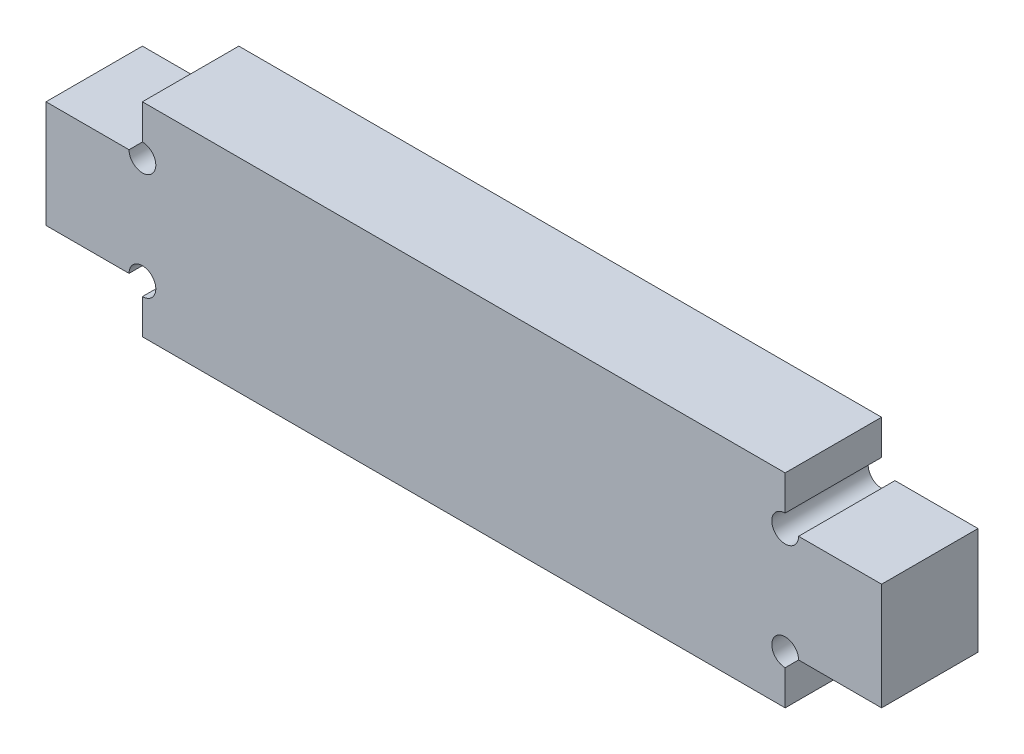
ISO-10303-21;
HEADER;
FILE_DESCRIPTION(('STEP AP214'),'2;1');
FILE_NAME('part.step','',(''),(''),'','','');
FILE_SCHEMA(('AUTOMOTIVE_DESIGN { 1 0 10303 214 1 1 1 1 }'));
ENDSEC;
DATA;
#1=APPLICATION_CONTEXT('core data for automotive mechanical design processes');
#2=APPLICATION_PROTOCOL_DEFINITION('international standard','automotive_design',2000,#1);
#3=PRODUCT_CONTEXT('',#1,'mechanical');
#4=PRODUCT('Part','Part','',(#3));
#5=PRODUCT_RELATED_PRODUCT_CATEGORY('part','',(#4));
#6=PRODUCT_DEFINITION_FORMATION('','',#4);
#7=PRODUCT_DEFINITION_CONTEXT('part definition',#1,'design');
#8=PRODUCT_DEFINITION('design','',#6,#7);
#9=PRODUCT_DEFINITION_SHAPE('','',#8);
#10=(LENGTH_UNIT() NAMED_UNIT(*) SI_UNIT(.MILLI.,.METRE.));
#11=(NAMED_UNIT(*) PLANE_ANGLE_UNIT() SI_UNIT($,.RADIAN.));
#12=(NAMED_UNIT(*) SI_UNIT($,.STERADIAN.) SOLID_ANGLE_UNIT());
#13=UNCERTAINTY_MEASURE_WITH_UNIT(LENGTH_MEASURE(1.E-05),#10,'distance_accuracy_value','');
#14=(GEOMETRIC_REPRESENTATION_CONTEXT(3) GLOBAL_UNCERTAINTY_ASSIGNED_CONTEXT((#13)) GLOBAL_UNIT_ASSIGNED_CONTEXT((#10,
#11,#12)) REPRESENTATION_CONTEXT('',''));
#15=CARTESIAN_POINT('',(0.,0.,0.));
#16=DIRECTION('',(0.,0.,1.));
#17=DIRECTION('',(1.,0.,0.));
#18=AXIS2_PLACEMENT_3D('',#15,#16,#17);
#19=CARTESIAN_POINT('',(-60.,-10.,18.));
#20=DIRECTION('',(0.,0.,-1.));
#21=DIRECTION('',(-1.,0.,0.));
#22=AXIS2_PLACEMENT_3D('',#19,#20,#21);
#23=CYLINDRICAL_SURFACE('',#22,2.5);
#24=CARTESIAN_POINT('',(-60.,-10.,0.));
#25=DIRECTION('',(0.,0.,-1.));
#26=DIRECTION('',(1.,0.,0.));
#27=AXIS2_PLACEMENT_3D('',#24,#25,#26);
#28=CIRCLE('',#27,2.5);
#29=CARTESIAN_POINT('',(-62.5,-10.,0.));
#30=VERTEX_POINT('',#29);
#31=CARTESIAN_POINT('',(-60.,-12.5,0.));
#32=VERTEX_POINT('',#31);
#33=EDGE_CURVE('E176',#30,#32,#28,.T.);
#34=ORIENTED_EDGE('',*,*,#33,.T.);
#35=DIRECTION('',(0.,0.,-1.));
#36=VECTOR('',#35,1.);
#37=CARTESIAN_POINT('',(-60.,-12.5,18.));
#38=LINE('',#37,#36);
#39=CARTESIAN_POINT('',(-60.,-12.5,18.));
#40=VERTEX_POINT('',#39);
#41=EDGE_CURVE('E11',#40,#32,#38,.T.);
#42=ORIENTED_EDGE('',*,*,#41,.F.);
#43=CARTESIAN_POINT('',(-60.,-10.,18.));
#44=DIRECTION('',(0.,0.,-1.));
#45=DIRECTION('',(1.,0.,0.));
#46=AXIS2_PLACEMENT_3D('',#43,#44,#45);
#47=CIRCLE('',#46,2.5);
#48=CARTESIAN_POINT('',(-62.5,-10.,18.));
#49=VERTEX_POINT('',#48);
#50=EDGE_CURVE('E206',#49,#40,#47,.T.);
#51=ORIENTED_EDGE('',*,*,#50,.F.);
#52=DIRECTION('',(0.,0.,-1.));
#53=VECTOR('',#52,1.);
#54=CARTESIAN_POINT('',(-62.5,-10.,18.));
#55=LINE('',#54,#53);
#56=EDGE_CURVE('E172',#49,#30,#55,.T.);
#57=ORIENTED_EDGE('',*,*,#56,.T.);
#58=EDGE_LOOP('',(#34,#42,#51,#57));
#59=FACE_BOUND('',#58,.T.);
#60=ADVANCED_FACE('F32',(#59),#23,.F.);
#61=CARTESIAN_POINT('',(-60.,-12.5,18.));
#62=DIRECTION('',(1.,0.,0.));
#63=DIRECTION('',(0.,0.,-1.));
#64=AXIS2_PLACEMENT_3D('',#61,#62,#63);
#65=PLANE('',#64);
#66=DIRECTION('',(0.,-1.,0.));
#67=VECTOR('',#66,1.);
#68=CARTESIAN_POINT('',(-60.,-12.5,0.));
#69=LINE('',#68,#67);
#70=CARTESIAN_POINT('',(-60.,-19.,0.));
#71=VERTEX_POINT('',#70);
#72=EDGE_CURVE('E179',#32,#71,#69,.T.);
#73=ORIENTED_EDGE('',*,*,#72,.T.);
#74=DIRECTION('',(0.,0.,-1.));
#75=VECTOR('',#74,1.);
#76=CARTESIAN_POINT('',(-60.,-19.,18.));
#77=LINE('',#76,#75);
#78=CARTESIAN_POINT('',(-60.,-19.,18.));
#79=VERTEX_POINT('',#78);
#80=EDGE_CURVE('E40',#79,#71,#77,.T.);
#81=ORIENTED_EDGE('',*,*,#80,.F.);
#82=DIRECTION('',(0.,-1.,0.));
#83=VECTOR('',#82,1.);
#84=CARTESIAN_POINT('',(-60.,-12.5,18.));
#85=LINE('',#84,#83);
#86=EDGE_CURVE('E115',#40,#79,#85,.T.);
#87=ORIENTED_EDGE('',*,*,#86,.F.);
#88=ORIENTED_EDGE('',*,*,#41,.T.);
#89=EDGE_LOOP('',(#73,#81,#87,#88));
#90=FACE_BOUND('',#89,.T.);
#91=ADVANCED_FACE('F304',(#90),#65,.F.);
#92=CARTESIAN_POINT('',(-60.,-19.,18.));
#93=DIRECTION('',(0.,1.,0.));
#94=DIRECTION('',(0.,0.,1.));
#95=AXIS2_PLACEMENT_3D('',#92,#93,#94);
#96=PLANE('',#95);
#97=DIRECTION('',(1.,0.,0.));
#98=VECTOR('',#97,1.);
#99=CARTESIAN_POINT('',(-60.,-19.,0.));
#100=LINE('',#99,#98);
#101=CARTESIAN_POINT('',(60.,-19.,0.));
#102=VERTEX_POINT('',#101);
#103=EDGE_CURVE('E181',#71,#102,#100,.T.);
#104=ORIENTED_EDGE('',*,*,#103,.T.);
#105=DIRECTION('',(0.,0.,-1.));
#106=VECTOR('',#105,1.);
#107=CARTESIAN_POINT('',(60.,-19.,18.));
#108=LINE('',#107,#106);
#109=CARTESIAN_POINT('',(60.,-19.,18.));
#110=VERTEX_POINT('',#109);
#111=EDGE_CURVE('E237',#110,#102,#108,.T.);
#112=ORIENTED_EDGE('',*,*,#111,.F.);
#113=DIRECTION('',(1.,0.,0.));
#114=VECTOR('',#113,1.);
#115=CARTESIAN_POINT('',(-60.,-19.,18.));
#116=LINE('',#115,#114);
#117=EDGE_CURVE('E245',#79,#110,#116,.T.);
#118=ORIENTED_EDGE('',*,*,#117,.F.);
#119=ORIENTED_EDGE('',*,*,#80,.T.);
#120=EDGE_LOOP('',(#104,#112,#118,#119));
#121=FACE_BOUND('',#120,.T.);
#122=ADVANCED_FACE('F243',(#121),#96,.F.);
#123=CARTESIAN_POINT('',(60.,-12.5,18.));
#124=DIRECTION('',(-1.,0.,0.));
#125=DIRECTION('',(0.,0.,1.));
#126=AXIS2_PLACEMENT_3D('',#123,#124,#125);
#127=PLANE('',#126);
#128=DIRECTION('',(0.,1.,0.));
#129=VECTOR('',#128,1.);
#130=CARTESIAN_POINT('',(60.,-12.5,0.));
#131=LINE('',#130,#129);
#132=CARTESIAN_POINT('',(60.,-12.5,0.));
#133=VERTEX_POINT('',#132);
#134=EDGE_CURVE('E183',#102,#133,#131,.T.);
#135=ORIENTED_EDGE('',*,*,#134,.T.);
#136=DIRECTION('',(0.,0.,-1.));
#137=VECTOR('',#136,1.);
#138=CARTESIAN_POINT('',(60.,-12.5,18.));
#139=LINE('',#138,#137);
#140=CARTESIAN_POINT('',(60.,-12.5,18.));
#141=VERTEX_POINT('',#140);
#142=EDGE_CURVE('E234',#141,#133,#139,.T.);
#143=ORIENTED_EDGE('',*,*,#142,.F.);
#144=DIRECTION('',(0.,1.,0.));
#145=VECTOR('',#144,1.);
#146=CARTESIAN_POINT('',(60.,-12.5,18.));
#147=LINE('',#146,#145);
#148=EDGE_CURVE('E263',#110,#141,#147,.T.);
#149=ORIENTED_EDGE('',*,*,#148,.F.);
#150=ORIENTED_EDGE('',*,*,#111,.T.);
#151=EDGE_LOOP('',(#135,#143,#149,#150));
#152=FACE_BOUND('',#151,.T.);
#153=ADVANCED_FACE('F254',(#152),#127,.F.);
#154=CARTESIAN_POINT('',(60.,-10.,18.));
#155=DIRECTION('',(0.,0.,-1.));
#156=DIRECTION('',(-1.,0.,0.));
#157=AXIS2_PLACEMENT_3D('',#154,#155,#156);
#158=CYLINDRICAL_SURFACE('',#157,2.5);
#159=CARTESIAN_POINT('',(60.,-10.,0.));
#160=DIRECTION('',(0.,0.,-1.));
#161=DIRECTION('',(-1.,0.,0.));
#162=AXIS2_PLACEMENT_3D('',#159,#160,#161);
#163=CIRCLE('',#162,2.5);
#164=CARTESIAN_POINT('',(62.5,-10.,0.));
#165=VERTEX_POINT('',#164);
#166=EDGE_CURVE('E185',#133,#165,#163,.T.);
#167=ORIENTED_EDGE('',*,*,#166,.T.);
#168=DIRECTION('',(0.,0.,-1.));
#169=VECTOR('',#168,1.);
#170=CARTESIAN_POINT('',(62.5,-10.,18.));
#171=LINE('',#170,#169);
#172=CARTESIAN_POINT('',(62.5,-10.,18.));
#173=VERTEX_POINT('',#172);
#174=EDGE_CURVE('E231',#173,#165,#171,.T.);
#175=ORIENTED_EDGE('',*,*,#174,.F.);
#176=CARTESIAN_POINT('',(60.,-10.,18.));
#177=DIRECTION('',(0.,0.,-1.));
#178=DIRECTION('',(-1.,0.,0.));
#179=AXIS2_PLACEMENT_3D('',#176,#177,#178);
#180=CIRCLE('',#179,2.5);
#181=EDGE_CURVE('E260',#141,#173,#180,.T.);
#182=ORIENTED_EDGE('',*,*,#181,.F.);
#183=ORIENTED_EDGE('',*,*,#142,.T.);
#184=EDGE_LOOP('',(#167,#175,#182,#183));
#185=FACE_BOUND('',#184,.T.);
#186=ADVANCED_FACE('F258',(#185),#158,.F.);
#187=CARTESIAN_POINT('',(78.,-10.,18.));
#188=DIRECTION('',(0.,1.,0.));
#189=DIRECTION('',(0.,0.,1.));
#190=AXIS2_PLACEMENT_3D('',#187,#188,#189);
#191=PLANE('',#190);
#192=DIRECTION('',(1.,0.,0.));
#193=VECTOR('',#192,1.);
#194=CARTESIAN_POINT('',(78.,-10.,0.));
#195=LINE('',#194,#193);
#196=CARTESIAN_POINT('',(78.,-10.,0.));
#197=VERTEX_POINT('',#196);
#198=EDGE_CURVE('E187',#165,#197,#195,.T.);
#199=ORIENTED_EDGE('',*,*,#198,.T.);
#200=DIRECTION('',(0.,0.,-1.));
#201=VECTOR('',#200,1.);
#202=CARTESIAN_POINT('',(78.,-10.,18.));
#203=LINE('',#202,#201);
#204=CARTESIAN_POINT('',(78.,-10.,18.));
#205=VERTEX_POINT('',#204);
#206=EDGE_CURVE('E228',#205,#197,#203,.T.);
#207=ORIENTED_EDGE('',*,*,#206,.F.);
#208=DIRECTION('',(1.,0.,0.));
#209=VECTOR('',#208,1.);
#210=CARTESIAN_POINT('',(78.,-10.,18.));
#211=LINE('',#210,#209);
#212=EDGE_CURVE('E262',#173,#205,#211,.T.);
#213=ORIENTED_EDGE('',*,*,#212,.F.);
#214=ORIENTED_EDGE('',*,*,#174,.T.);
#215=EDGE_LOOP('',(#199,#207,#213,#214));
#216=FACE_BOUND('',#215,.T.);
#217=ADVANCED_FACE('F317',(#216),#191,.F.);
#218=CARTESIAN_POINT('',(78.,-10.,18.));
#219=DIRECTION('',(-1.,0.,0.));
#220=DIRECTION('',(0.,-1.,0.));
#221=AXIS2_PLACEMENT_3D('',#218,#219,#220);
#222=PLANE('',#221);
#223=DIRECTION('',(0.,1.,0.));
#224=VECTOR('',#223,1.);
#225=CARTESIAN_POINT('',(78.,-10.,0.));
#226=LINE('',#225,#224);
#227=CARTESIAN_POINT('',(78.,10.,0.));
#228=VERTEX_POINT('',#227);
#229=EDGE_CURVE('E189',#197,#228,#226,.T.);
#230=ORIENTED_EDGE('',*,*,#229,.T.);
#231=DIRECTION('',(0.,0.,-1.));
#232=VECTOR('',#231,1.);
#233=CARTESIAN_POINT('',(78.,10.,18.));
#234=LINE('',#233,#232);
#235=CARTESIAN_POINT('',(78.,10.,18.));
#236=VERTEX_POINT('',#235);
#237=EDGE_CURVE('E225',#236,#228,#234,.T.);
#238=ORIENTED_EDGE('',*,*,#237,.F.);
#239=DIRECTION('',(0.,1.,0.));
#240=VECTOR('',#239,1.);
#241=CARTESIAN_POINT('',(78.,-10.,18.));
#242=LINE('',#241,#240);
#243=EDGE_CURVE('E265',#205,#236,#242,.T.);
#244=ORIENTED_EDGE('',*,*,#243,.F.);
#245=ORIENTED_EDGE('',*,*,#206,.T.);
#246=EDGE_LOOP('',(#230,#238,#244,#245));
#247=FACE_BOUND('',#246,.T.);
#248=ADVANCED_FACE('F320',(#247),#222,.F.);
#249=CARTESIAN_POINT('',(78.,10.,18.));
#250=DIRECTION('',(0.,-1.,0.));
#251=DIRECTION('',(0.,0.,-1.));
#252=AXIS2_PLACEMENT_3D('',#249,#250,#251);
#253=PLANE('',#252);
#254=DIRECTION('',(-1.,0.,0.));
#255=VECTOR('',#254,1.);
#256=CARTESIAN_POINT('',(78.,10.,0.));
#257=LINE('',#256,#255);
#258=CARTESIAN_POINT('',(62.5,10.,0.));
#259=VERTEX_POINT('',#258);
#260=EDGE_CURVE('E191',#228,#259,#257,.T.);
#261=ORIENTED_EDGE('',*,*,#260,.T.);
#262=DIRECTION('',(0.,0.,-1.));
#263=VECTOR('',#262,1.);
#264=CARTESIAN_POINT('',(62.5,10.,18.));
#265=LINE('',#264,#263);
#266=CARTESIAN_POINT('',(62.5,10.,18.));
#267=VERTEX_POINT('',#266);
#268=EDGE_CURVE('E222',#267,#259,#265,.T.);
#269=ORIENTED_EDGE('',*,*,#268,.F.);
#270=DIRECTION('',(-1.,0.,0.));
#271=VECTOR('',#270,1.);
#272=CARTESIAN_POINT('',(78.,10.,18.));
#273=LINE('',#272,#271);
#274=EDGE_CURVE('E271',#236,#267,#273,.T.);
#275=ORIENTED_EDGE('',*,*,#274,.F.);
#276=ORIENTED_EDGE('',*,*,#237,.T.);
#277=EDGE_LOOP('',(#261,#269,#275,#276));
#278=FACE_BOUND('',#277,.T.);
#279=ADVANCED_FACE('F324',(#278),#253,.F.);
#280=CARTESIAN_POINT('',(60.,10.,18.));
#281=DIRECTION('',(0.,0.,-1.));
#282=DIRECTION('',(-1.,0.,0.));
#283=AXIS2_PLACEMENT_3D('',#280,#281,#282);
#284=CYLINDRICAL_SURFACE('',#283,2.5);
#285=CARTESIAN_POINT('',(60.,10.,0.));
#286=DIRECTION('',(0.,0.,-1.));
#287=DIRECTION('',(-1.,0.,0.));
#288=AXIS2_PLACEMENT_3D('',#285,#286,#287);
#289=CIRCLE('',#288,2.5);
#290=CARTESIAN_POINT('',(60.,12.5,0.));
#291=VERTEX_POINT('',#290);
#292=EDGE_CURVE('E193',#259,#291,#289,.T.);
#293=ORIENTED_EDGE('',*,*,#292,.T.);
#294=DIRECTION('',(0.,0.,-1.));
#295=VECTOR('',#294,1.);
#296=CARTESIAN_POINT('',(60.,12.5,18.));
#297=LINE('',#296,#295);
#298=CARTESIAN_POINT('',(60.,12.5,18.));
#299=VERTEX_POINT('',#298);
#300=EDGE_CURVE('E219',#299,#291,#297,.T.);
#301=ORIENTED_EDGE('',*,*,#300,.F.);
#302=CARTESIAN_POINT('',(60.,10.,18.));
#303=DIRECTION('',(0.,0.,-1.));
#304=DIRECTION('',(-1.,0.,0.));
#305=AXIS2_PLACEMENT_3D('',#302,#303,#304);
#306=CIRCLE('',#305,2.5);
#307=EDGE_CURVE('E273',#267,#299,#306,.T.);
#308=ORIENTED_EDGE('',*,*,#307,.F.);
#309=ORIENTED_EDGE('',*,*,#268,.T.);
#310=EDGE_LOOP('',(#293,#301,#308,#309));
#311=FACE_BOUND('',#310,.T.);
#312=ADVANCED_FACE('F328',(#311),#284,.F.);
#313=CARTESIAN_POINT('',(60.,12.5,18.));
#314=DIRECTION('',(-1.,0.,0.));
#315=DIRECTION('',(0.,0.,1.));
#316=AXIS2_PLACEMENT_3D('',#313,#314,#315);
#317=PLANE('',#316);
#318=DIRECTION('',(0.,1.,0.));
#319=VECTOR('',#318,1.);
#320=CARTESIAN_POINT('',(60.,12.5,0.));
#321=LINE('',#320,#319);
#322=CARTESIAN_POINT('',(60.,19.,0.));
#323=VERTEX_POINT('',#322);
#324=EDGE_CURVE('E195',#291,#323,#321,.T.);
#325=ORIENTED_EDGE('',*,*,#324,.T.);
#326=DIRECTION('',(0.,0.,-1.));
#327=VECTOR('',#326,1.);
#328=CARTESIAN_POINT('',(60.,19.,18.));
#329=LINE('',#328,#327);
#330=CARTESIAN_POINT('',(60.,19.,18.));
#331=VERTEX_POINT('',#330);
#332=EDGE_CURVE('E216',#331,#323,#329,.T.);
#333=ORIENTED_EDGE('',*,*,#332,.F.);
#334=DIRECTION('',(0.,1.,0.));
#335=VECTOR('',#334,1.);
#336=CARTESIAN_POINT('',(60.,12.5,18.));
#337=LINE('',#336,#335);
#338=EDGE_CURVE('E275',#299,#331,#337,.T.);
#339=ORIENTED_EDGE('',*,*,#338,.F.);
#340=ORIENTED_EDGE('',*,*,#300,.T.);
#341=EDGE_LOOP('',(#325,#333,#339,#340));
#342=FACE_BOUND('',#341,.T.);
#343=ADVANCED_FACE('F332',(#342),#317,.F.);
#344=CARTESIAN_POINT('',(-60.,19.,18.));
#345=DIRECTION('',(0.,-1.,0.));
#346=DIRECTION('',(0.,0.,-1.));
#347=AXIS2_PLACEMENT_3D('',#344,#345,#346);
#348=PLANE('',#347);
#349=DIRECTION('',(-1.,0.,0.));
#350=VECTOR('',#349,1.);
#351=CARTESIAN_POINT('',(-60.,19.,0.));
#352=LINE('',#351,#350);
#353=CARTESIAN_POINT('',(-60.,19.,0.));
#354=VERTEX_POINT('',#353);
#355=EDGE_CURVE('E197',#323,#354,#352,.T.);
#356=ORIENTED_EDGE('',*,*,#355,.T.);
#357=DIRECTION('',(0.,0.,-1.));
#358=VECTOR('',#357,1.);
#359=CARTESIAN_POINT('',(-60.,19.,18.));
#360=LINE('',#359,#358);
#361=CARTESIAN_POINT('',(-60.,19.,18.));
#362=VERTEX_POINT('',#361);
#363=EDGE_CURVE('E213',#362,#354,#360,.T.);
#364=ORIENTED_EDGE('',*,*,#363,.F.);
#365=DIRECTION('',(-1.,0.,0.));
#366=VECTOR('',#365,1.);
#367=CARTESIAN_POINT('',(-60.,19.,18.));
#368=LINE('',#367,#366);
#369=EDGE_CURVE('E277',#331,#362,#368,.T.);
#370=ORIENTED_EDGE('',*,*,#369,.F.);
#371=ORIENTED_EDGE('',*,*,#332,.T.);
#372=EDGE_LOOP('',(#356,#364,#370,#371));
#373=FACE_BOUND('',#372,.T.);
#374=ADVANCED_FACE('F336',(#373),#348,.F.);
#375=CARTESIAN_POINT('',(-60.,12.5,18.));
#376=DIRECTION('',(1.,0.,0.));
#377=DIRECTION('',(0.,0.,-1.));
#378=AXIS2_PLACEMENT_3D('',#375,#376,#377);
#379=PLANE('',#378);
#380=DIRECTION('',(0.,-1.,0.));
#381=VECTOR('',#380,1.);
#382=CARTESIAN_POINT('',(-60.,12.5,0.));
#383=LINE('',#382,#381);
#384=CARTESIAN_POINT('',(-60.,12.5,0.));
#385=VERTEX_POINT('',#384);
#386=EDGE_CURVE('E199',#354,#385,#383,.T.);
#387=ORIENTED_EDGE('',*,*,#386,.T.);
#388=DIRECTION('',(0.,0.,-1.));
#389=VECTOR('',#388,1.);
#390=CARTESIAN_POINT('',(-60.,12.5,18.));
#391=LINE('',#390,#389);
#392=CARTESIAN_POINT('',(-60.,12.5,18.));
#393=VERTEX_POINT('',#392);
#394=EDGE_CURVE('E210',#393,#385,#391,.T.);
#395=ORIENTED_EDGE('',*,*,#394,.F.);
#396=DIRECTION('',(0.,-1.,0.));
#397=VECTOR('',#396,1.);
#398=CARTESIAN_POINT('',(-60.,12.5,18.));
#399=LINE('',#398,#397);
#400=EDGE_CURVE('E279',#362,#393,#399,.T.);
#401=ORIENTED_EDGE('',*,*,#400,.F.);
#402=ORIENTED_EDGE('',*,*,#363,.T.);
#403=EDGE_LOOP('',(#387,#395,#401,#402));
#404=FACE_BOUND('',#403,.T.);
#405=ADVANCED_FACE('F285',(#404),#379,.F.);
#406=CARTESIAN_POINT('',(-60.,10.,18.));
#407=DIRECTION('',(0.,0.,-1.));
#408=DIRECTION('',(-1.,0.,0.));
#409=AXIS2_PLACEMENT_3D('',#406,#407,#408);
#410=CYLINDRICAL_SURFACE('',#409,2.5);
#411=CARTESIAN_POINT('',(-60.,10.,0.));
#412=DIRECTION('',(0.,0.,-1.));
#413=DIRECTION('',(1.,0.,0.));
#414=AXIS2_PLACEMENT_3D('',#411,#412,#413);
#415=CIRCLE('',#414,2.5);
#416=CARTESIAN_POINT('',(-62.5,10.,0.));
#417=VERTEX_POINT('',#416);
#418=EDGE_CURVE('E201',#385,#417,#415,.T.);
#419=ORIENTED_EDGE('',*,*,#418,.T.);
#420=DIRECTION('',(0.,0.,-1.));
#421=VECTOR('',#420,1.);
#422=CARTESIAN_POINT('',(-62.5,10.,18.));
#423=LINE('',#422,#421);
#424=CARTESIAN_POINT('',(-62.5,10.,18.));
#425=VERTEX_POINT('',#424);
#426=EDGE_CURVE('E167',#425,#417,#423,.T.);
#427=ORIENTED_EDGE('',*,*,#426,.F.);
#428=CARTESIAN_POINT('',(-60.,10.,18.));
#429=DIRECTION('',(0.,0.,-1.));
#430=DIRECTION('',(1.,0.,0.));
#431=AXIS2_PLACEMENT_3D('',#428,#429,#430);
#432=CIRCLE('',#431,2.5);
#433=EDGE_CURVE('E158',#393,#425,#432,.T.);
#434=ORIENTED_EDGE('',*,*,#433,.F.);
#435=ORIENTED_EDGE('',*,*,#394,.T.);
#436=EDGE_LOOP('',(#419,#427,#434,#435));
#437=FACE_BOUND('',#436,.T.);
#438=ADVANCED_FACE('F289',(#437),#410,.F.);
#439=CARTESIAN_POINT('',(-78.,10.,18.));
#440=DIRECTION('',(0.,-1.,0.));
#441=DIRECTION('',(0.,0.,-1.));
#442=AXIS2_PLACEMENT_3D('',#439,#440,#441);
#443=PLANE('',#442);
#444=DIRECTION('',(-1.,0.,0.));
#445=VECTOR('',#444,1.);
#446=CARTESIAN_POINT('',(-78.,10.,0.));
#447=LINE('',#446,#445);
#448=CARTESIAN_POINT('',(-78.,10.,0.));
#449=VERTEX_POINT('',#448);
#450=EDGE_CURVE('E166',#417,#449,#447,.T.);
#451=ORIENTED_EDGE('',*,*,#450,.T.);
#452=DIRECTION('',(0.,0.,-1.));
#453=VECTOR('',#452,1.);
#454=CARTESIAN_POINT('',(-78.,10.,18.));
#455=LINE('',#454,#453);
#456=CARTESIAN_POINT('',(-78.,10.,18.));
#457=VERTEX_POINT('',#456);
#458=EDGE_CURVE('E163',#457,#449,#455,.T.);
#459=ORIENTED_EDGE('',*,*,#458,.F.);
#460=DIRECTION('',(-1.,0.,0.));
#461=VECTOR('',#460,1.);
#462=CARTESIAN_POINT('',(-78.,10.,18.));
#463=LINE('',#462,#461);
#464=EDGE_CURVE('E152',#425,#457,#463,.T.);
#465=ORIENTED_EDGE('',*,*,#464,.F.);
#466=ORIENTED_EDGE('',*,*,#426,.T.);
#467=EDGE_LOOP('',(#451,#459,#465,#466));
#468=FACE_BOUND('',#467,.T.);
#469=ADVANCED_FACE('F164',(#468),#443,.F.);
#470=CARTESIAN_POINT('',(-78.,-10.,18.));
#471=DIRECTION('',(1.,0.,0.));
#472=DIRECTION('',(0.,1.,0.));
#473=AXIS2_PLACEMENT_3D('',#470,#471,#472);
#474=PLANE('',#473);
#475=DIRECTION('',(0.,-1.,0.));
#476=VECTOR('',#475,1.);
#477=CARTESIAN_POINT('',(-78.,-10.,0.));
#478=LINE('',#477,#476);
#479=CARTESIAN_POINT('',(-78.,-10.,0.));
#480=VERTEX_POINT('',#479);
#481=EDGE_CURVE('E101',#449,#480,#478,.T.);
#482=ORIENTED_EDGE('',*,*,#481,.T.);
#483=DIRECTION('',(0.,0.,-1.));
#484=VECTOR('',#483,1.);
#485=CARTESIAN_POINT('',(-78.,-10.,18.));
#486=LINE('',#485,#484);
#487=CARTESIAN_POINT('',(-78.,-10.,18.));
#488=VERTEX_POINT('',#487);
#489=EDGE_CURVE('E168',#488,#480,#486,.T.);
#490=ORIENTED_EDGE('',*,*,#489,.F.);
#491=DIRECTION('',(0.,-1.,0.));
#492=VECTOR('',#491,1.);
#493=CARTESIAN_POINT('',(-78.,-10.,18.));
#494=LINE('',#493,#492);
#495=EDGE_CURVE('E156',#457,#488,#494,.T.);
#496=ORIENTED_EDGE('',*,*,#495,.F.);
#497=ORIENTED_EDGE('',*,*,#458,.T.);
#498=EDGE_LOOP('',(#482,#490,#496,#497));
#499=FACE_BOUND('',#498,.T.);
#500=ADVANCED_FACE('F170',(#499),#474,.F.);
#501=CARTESIAN_POINT('',(-78.,-10.,18.));
#502=DIRECTION('',(0.,1.,0.));
#503=DIRECTION('',(0.,0.,1.));
#504=AXIS2_PLACEMENT_3D('',#501,#502,#503);
#505=PLANE('',#504);
#506=DIRECTION('',(1.,0.,0.));
#507=VECTOR('',#506,1.);
#508=CARTESIAN_POINT('',(-78.,-10.,0.));
#509=LINE('',#508,#507);
#510=EDGE_CURVE('E107',#480,#30,#509,.T.);
#511=ORIENTED_EDGE('',*,*,#510,.T.);
#512=ORIENTED_EDGE('',*,*,#56,.F.);
#513=DIRECTION('',(1.,0.,0.));
#514=VECTOR('',#513,1.);
#515=CARTESIAN_POINT('',(-78.,-10.,18.));
#516=LINE('',#515,#514);
#517=EDGE_CURVE('E48',#488,#49,#516,.T.);
#518=ORIENTED_EDGE('',*,*,#517,.F.);
#519=ORIENTED_EDGE('',*,*,#489,.T.);
#520=EDGE_LOOP('',(#511,#512,#518,#519));
#521=FACE_BOUND('',#520,.T.);
#522=ADVANCED_FACE('F293',(#521),#505,.F.);
#523=CARTESIAN_POINT('',(-60.,-10.,18.));
#524=DIRECTION('',(0.,0.,1.));
#525=DIRECTION('',(1.,0.,0.));
#526=AXIS2_PLACEMENT_3D('',#523,#524,#525);
#527=PLANE('',#526);
#528=ORIENTED_EDGE('',*,*,#50,.T.);
#529=ORIENTED_EDGE('',*,*,#86,.T.);
#530=ORIENTED_EDGE('',*,*,#117,.T.);
#531=ORIENTED_EDGE('',*,*,#148,.T.);
#532=ORIENTED_EDGE('',*,*,#181,.T.);
#533=ORIENTED_EDGE('',*,*,#212,.T.);
#534=ORIENTED_EDGE('',*,*,#243,.T.);
#535=ORIENTED_EDGE('',*,*,#274,.T.);
#536=ORIENTED_EDGE('',*,*,#307,.T.);
#537=ORIENTED_EDGE('',*,*,#338,.T.);
#538=ORIENTED_EDGE('',*,*,#369,.T.);
#539=ORIENTED_EDGE('',*,*,#400,.T.);
#540=ORIENTED_EDGE('',*,*,#433,.T.);
#541=ORIENTED_EDGE('',*,*,#464,.T.);
#542=ORIENTED_EDGE('',*,*,#495,.T.);
#543=ORIENTED_EDGE('',*,*,#517,.T.);
#544=EDGE_LOOP('',(#528,#529,#530,#531,#532,#533,#534,#535,#536,#537,#538,#539,#540,#541,#542,#543));
#545=FACE_BOUND('',#544,.T.);
#546=ADVANCED_FACE('F154',(#545),#527,.T.);
#547=CARTESIAN_POINT('',(-60.,-10.,0.));
#548=DIRECTION('',(0.,0.,1.));
#549=DIRECTION('',(1.,0.,0.));
#550=AXIS2_PLACEMENT_3D('',#547,#548,#549);
#551=PLANE('',#550);
#552=ORIENTED_EDGE('',*,*,#33,.F.);
#553=ORIENTED_EDGE('',*,*,#510,.F.);
#554=ORIENTED_EDGE('',*,*,#481,.F.);
#555=ORIENTED_EDGE('',*,*,#450,.F.);
#556=ORIENTED_EDGE('',*,*,#418,.F.);
#557=ORIENTED_EDGE('',*,*,#386,.F.);
#558=ORIENTED_EDGE('',*,*,#355,.F.);
#559=ORIENTED_EDGE('',*,*,#324,.F.);
#560=ORIENTED_EDGE('',*,*,#292,.F.);
#561=ORIENTED_EDGE('',*,*,#260,.F.);
#562=ORIENTED_EDGE('',*,*,#229,.F.);
#563=ORIENTED_EDGE('',*,*,#198,.F.);
#564=ORIENTED_EDGE('',*,*,#166,.F.);
#565=ORIENTED_EDGE('',*,*,#134,.F.);
#566=ORIENTED_EDGE('',*,*,#103,.F.);
#567=ORIENTED_EDGE('',*,*,#72,.F.);
#568=EDGE_LOOP('',(#552,#553,#554,#555,#556,#557,#558,#559,#560,#561,#562,#563,#564,#565,#566,#567));
#569=FACE_BOUND('',#568,.T.);
#570=ADVANCED_FACE('F249',(#569),#551,.F.);
#571=CLOSED_SHELL('',(#60,#91,#122,#153,#186,#217,#248,#279,#312,#343,#374,#405,#438,#469,#500,
#522,#546,#570));
#572=MANIFOLD_SOLID_BREP('B2',#571);
#573=ADVANCED_BREP_SHAPE_REPRESENTATION('',(#18,#572),#14);
#574=SHAPE_DEFINITION_REPRESENTATION(#9,#573);
ENDSEC;
END-ISO-10303-21;
